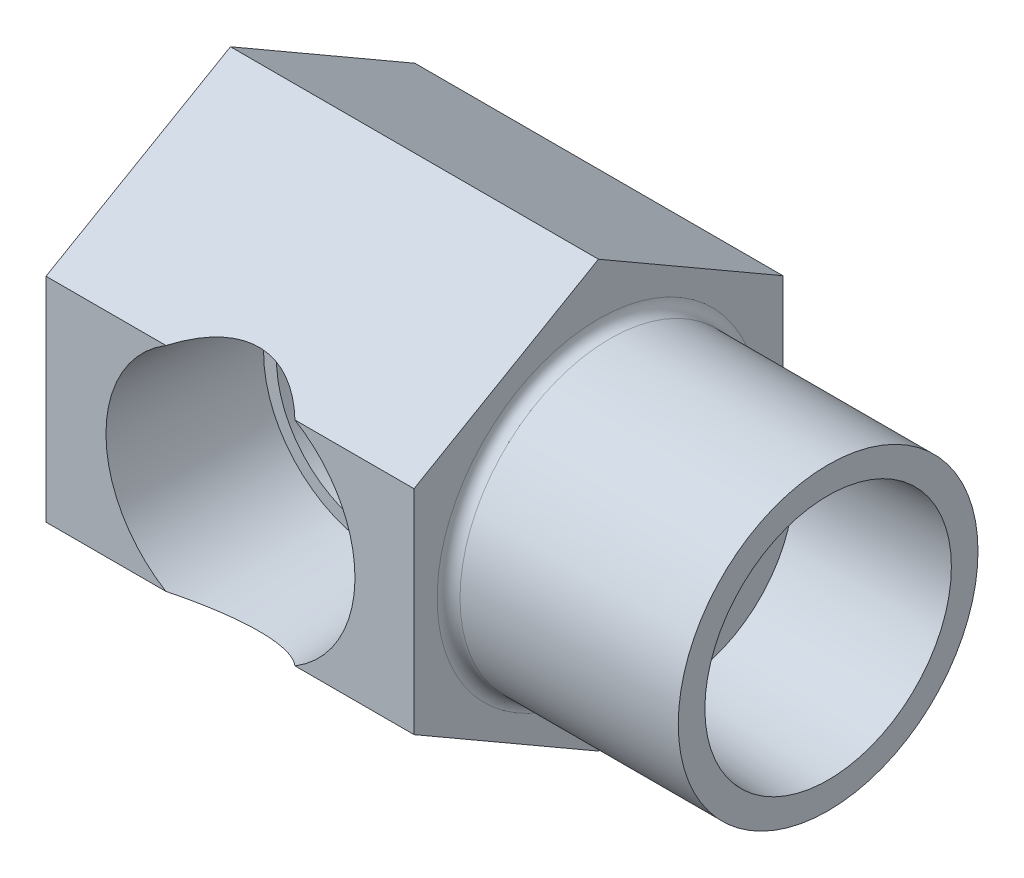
ISO-10303-21;
HEADER;
FILE_DESCRIPTION(('STEP AP214'),'2;1');
FILE_NAME('part.step','',(''),(''),'','','');
FILE_SCHEMA(('AUTOMOTIVE_DESIGN { 1 0 10303 214 1 1 1 1 }'));
ENDSEC;
DATA;
#1=APPLICATION_CONTEXT('core data for automotive mechanical design processes');
#2=APPLICATION_PROTOCOL_DEFINITION('international standard','automotive_design',2000,#1);
#3=PRODUCT_CONTEXT('',#1,'mechanical');
#4=PRODUCT('Part','Part','',(#3));
#5=PRODUCT_RELATED_PRODUCT_CATEGORY('part','',(#4));
#6=PRODUCT_DEFINITION_FORMATION('','',#4);
#7=PRODUCT_DEFINITION_CONTEXT('part definition',#1,'design');
#8=PRODUCT_DEFINITION('design','',#6,#7);
#9=PRODUCT_DEFINITION_SHAPE('','',#8);
#10=(LENGTH_UNIT() NAMED_UNIT(*) SI_UNIT(.MILLI.,.METRE.));
#11=(NAMED_UNIT(*) PLANE_ANGLE_UNIT() SI_UNIT($,.RADIAN.));
#12=(NAMED_UNIT(*) SI_UNIT($,.STERADIAN.) SOLID_ANGLE_UNIT());
#13=UNCERTAINTY_MEASURE_WITH_UNIT(LENGTH_MEASURE(1.E-05),#10,'distance_accuracy_value','');
#14=(GEOMETRIC_REPRESENTATION_CONTEXT(3) GLOBAL_UNCERTAINTY_ASSIGNED_CONTEXT((#13)) GLOBAL_UNIT_ASSIGNED_CONTEXT((#10,
#11,#12)) REPRESENTATION_CONTEXT('',''));
#15=CARTESIAN_POINT('',(0.,0.,0.));
#16=DIRECTION('',(0.,0.,1.));
#17=DIRECTION('',(1.,0.,0.));
#18=AXIS2_PLACEMENT_3D('',#15,#16,#17);
#19=CARTESIAN_POINT('',(-30.099,0.,21.5872041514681));
#20=DIRECTION('',(0.,0.,-1.));
#21=DIRECTION('',(-1.,0.,0.));
#22=AXIS2_PLACEMENT_3D('',#19,#20,#21);
#23=CYLINDRICAL_SURFACE('',#22,7.14406750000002);
#24=CARTESIAN_POINT('',(-25.1825171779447,5.18323230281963,-5.10306883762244));
#25=CARTESIAN_POINT('',(-25.2134358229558,5.2125364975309,-4.99724778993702));
#26=CARTESIAN_POINT('',(-25.2411529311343,5.23832352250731,-4.88948289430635));
#27=CARTESIAN_POINT('',(-25.2894866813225,5.28274794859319,-4.67094800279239));
#28=CARTESIAN_POINT('',(-25.3101041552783,5.30138618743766,-4.56017836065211));
#29=CARTESIAN_POINT('',(-25.3433476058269,5.33122407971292,-4.33783712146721));
#30=CARTESIAN_POINT('',(-25.3560667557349,5.34251054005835,-4.22629121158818));
#31=CARTESIAN_POINT('',(-25.3736800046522,5.35809609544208,-4.00212245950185));
#32=CARTESIAN_POINT('',(-25.3785751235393,5.36239610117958,-3.88949975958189));
#33=CARTESIAN_POINT('',(-25.3806951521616,5.36426148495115,-3.66416077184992));
#34=CARTESIAN_POINT('',(-25.3779217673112,5.36182836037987,-3.55144451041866));
#35=CARTESIAN_POINT('',(-25.3652086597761,5.35060568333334,-3.32671545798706));
#36=CARTESIAN_POINT('',(-25.3552653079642,5.341812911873,-3.2147030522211));
#37=CARTESIAN_POINT('',(-25.3156604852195,5.3064747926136,-2.88023991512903));
#38=CARTESIAN_POINT('',(-25.276225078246,5.27096911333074,-2.65981840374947));
#39=CARTESIAN_POINT('',(-25.1892935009,5.18990438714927,-2.27722295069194));
#40=CARTESIAN_POINT('',(-25.1456647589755,5.14846263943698,-2.11319388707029));
#41=CARTESIAN_POINT('',(-25.0497782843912,5.05446126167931,-1.790841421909));
#42=CARTESIAN_POINT('',(-24.9975155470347,5.001895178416,-1.63252139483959));
#43=CARTESIAN_POINT('',(-24.8866886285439,4.88630068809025,-1.32161419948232));
#44=CARTESIAN_POINT('',(-24.8281100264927,4.82324815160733,-1.1690412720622));
#45=CARTESIAN_POINT('',(-24.7067840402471,4.6872183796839,-0.870161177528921));
#46=CARTESIAN_POINT('',(-24.6440374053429,4.61424292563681,-0.723852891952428));
#47=CARTESIAN_POINT('',(-24.5125913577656,4.45432658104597,-0.429915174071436));
#48=CARTESIAN_POINT('',(-24.4437535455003,4.3668437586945,-0.28264245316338));
#49=CARTESIAN_POINT('',(-24.3050184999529,4.18102036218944,0.00439596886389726));
#50=CARTESIAN_POINT('',(-24.2351211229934,4.08267830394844,0.144160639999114));
#51=CARTESIAN_POINT('',(-24.0959483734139,3.87513309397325,0.415323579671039));
#52=CARTESIAN_POINT('',(-24.0266721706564,3.76594796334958,0.546735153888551));
#53=CARTESIAN_POINT('',(-23.8901779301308,3.53639131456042,0.800456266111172));
#54=CARTESIAN_POINT('',(-23.8229593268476,3.41602290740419,0.9227683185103));
#55=CARTESIAN_POINT('',(-23.6562040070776,3.09458840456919,1.22140921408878));
#56=CARTESIAN_POINT('',(-23.5591371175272,2.88543982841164,1.39061980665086));
#57=CARTESIAN_POINT('',(-23.3800788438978,2.4395435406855,1.69775818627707));
#58=CARTESIAN_POINT('',(-23.2980682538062,2.20283162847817,1.83572588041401));
#59=CARTESIAN_POINT('',(-23.169666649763,1.75103882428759,2.04959929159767));
#60=CARTESIAN_POINT('',(-23.1194728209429,1.54032842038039,2.13230684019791));
#61=CARTESIAN_POINT('',(-23.0580655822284,1.21458401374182,2.23300187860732));
#62=CARTESIAN_POINT('',(-23.039908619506,1.10437093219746,2.26267539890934));
#63=CARTESIAN_POINT('',(-23.0086150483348,0.881358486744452,2.31372005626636));
#64=CARTESIAN_POINT('',(-22.9954762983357,0.76856024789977,2.3350947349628));
#65=CARTESIAN_POINT('',(-22.9744822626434,0.540500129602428,2.36921140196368));
#66=CARTESIAN_POINT('',(-22.9666581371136,0.425227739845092,2.38190248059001));
#67=CARTESIAN_POINT('',(-22.9566224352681,0.193793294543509,2.39817581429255));
#68=CARTESIAN_POINT('',(-22.9544108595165,0.0776312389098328,2.40175806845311));
#69=CARTESIAN_POINT('',(-22.955661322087,-0.154575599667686,2.39973161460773));
#70=CARTESIAN_POINT('',(-22.9591231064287,-0.270620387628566,2.39412331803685));
#71=CARTESIAN_POINT('',(-22.9716252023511,-0.501604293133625,2.37384366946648));
#72=CARTESIAN_POINT('',(-22.9806653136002,-0.616543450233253,2.35917264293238));
#73=CARTESIAN_POINT('',(-23.0030876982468,-0.834690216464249,2.32270942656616));
#74=CARTESIAN_POINT('',(-23.0160344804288,-0.938063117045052,2.30163032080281));
#75=CARTESIAN_POINT('',(-23.0461272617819,-1.14253259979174,2.25251224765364));
#76=CARTESIAN_POINT('',(-23.0632745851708,-1.24362845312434,2.22447108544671));
#77=CARTESIAN_POINT('',(-23.1205336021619,-1.54266726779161,2.13054149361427));
#78=CARTESIAN_POINT('',(-23.1664750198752,-1.73647942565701,2.05482655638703));
#79=CARTESIAN_POINT('',(-23.2917093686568,-2.18452681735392,1.84642606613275));
#80=CARTESIAN_POINT('',(-23.3769973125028,-2.43206385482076,1.70306138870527));
#81=CARTESIAN_POINT('',(-23.5639813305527,-2.89730642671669,1.38229283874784));
#82=CARTESIAN_POINT('',(-23.6657145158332,-3.11494238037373,1.20481180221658));
#83=CARTESIAN_POINT('',(-23.8444772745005,-3.45587099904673,0.883882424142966));
#84=CARTESIAN_POINT('',(-23.9191235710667,-3.58721005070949,0.747463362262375));
#85=CARTESIAN_POINT('',(-24.0706021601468,-3.83632287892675,0.463752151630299));
#86=CARTESIAN_POINT('',(-24.1474353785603,-3.95409079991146,0.316455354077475));
#87=CARTESIAN_POINT('',(-24.3013098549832,-4.17645741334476,0.0119885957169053));
#88=CARTESIAN_POINT('',(-24.3783512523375,-4.28103618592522,-0.145195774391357));
#89=CARTESIAN_POINT('',(-24.530364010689,-4.47698025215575,-0.468487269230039));
#90=CARTESIAN_POINT('',(-24.6053359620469,-4.56834934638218,-0.63459180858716));
#91=CARTESIAN_POINT('',(-24.7372252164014,-4.72200481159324,-0.943602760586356));
#92=CARTESIAN_POINT('',(-24.7949050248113,-4.78653859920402,-1.08506990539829));
#93=CARTESIAN_POINT('',(-24.9057234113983,-4.9065513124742,-1.37356011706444));
#94=CARTESIAN_POINT('',(-24.9588615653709,-4.96202939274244,-1.52058370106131));
#95=CARTESIAN_POINT('',(-25.0585765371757,-5.06328662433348,-1.81962761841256));
#96=CARTESIAN_POINT('',(-25.105171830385,-5.10909327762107,-1.97163232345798));
#97=CARTESIAN_POINT('',(-25.1897450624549,-5.19040898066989,-2.28062074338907));
#98=CARTESIAN_POINT('',(-25.2277274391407,-5.2259233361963,-2.43760184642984));
#99=CARTESIAN_POINT('',(-25.3038875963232,-5.29605796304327,-2.81193496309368));
#100=CARTESIAN_POINT('',(-25.337494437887,-5.32602798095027,-3.03121193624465));
#101=CARTESIAN_POINT('',(-25.3678543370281,-5.35295298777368,-3.36310665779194));
#102=CARTESIAN_POINT('',(-25.3746346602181,-5.35892494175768,-3.474161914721));
#103=CARTESIAN_POINT('',(-25.3809554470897,-5.36449322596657,-3.69661859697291));
#104=CARTESIAN_POINT('',(-25.3804997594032,-5.36409294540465,-3.80801980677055));
#105=CARTESIAN_POINT('',(-25.3723916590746,-5.35694836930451,-4.02011673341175));
#106=CARTESIAN_POINT('',(-25.3654024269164,-5.35078866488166,-4.12085817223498));
#107=CARTESIAN_POINT('',(-25.3451606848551,-5.33281293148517,-4.32121383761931));
#108=CARTESIAN_POINT('',(-25.3319077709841,-5.32099653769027,-4.4208279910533));
#109=CARTESIAN_POINT('',(-25.2992340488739,-5.29154446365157,-4.61905715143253));
#110=CARTESIAN_POINT('',(-25.2797612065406,-5.27385963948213,-4.71765621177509));
#111=CARTESIAN_POINT('',(-25.2352108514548,-5.23279404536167,-4.91237330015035));
#112=CARTESIAN_POINT('',(-25.2101333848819,-5.20941332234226,-5.00849134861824));
#113=CARTESIAN_POINT('',(-25.1825171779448,-5.18323230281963,-5.10306883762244));
#114=B_SPLINE_CURVE_WITH_KNOTS('',3,(#24,#25,#26,#27,#28,#29,#30,#31,#32,#33,#34,#35,#36,#37,
#38,#39,#40,#41,#42,#43,#44,#45,#46,#47,#48,#49,#50,#51,#52,#53,#54,#55,#56,#57,#58,#59,#60,#61,
#62,#63,#64,#65,#66,#67,#68,#69,#70,#71,#72,#73,#74,#75,#76,#77,#78,#79,#80,#81,#82,#83,#84,#85,
#86,#87,#88,#89,#90,#91,#92,#93,#94,#95,#96,#97,#98,#99,#100,#101,#102,#103,#104,#105,#106,#107,
#108,#109,#110,#111,#112,#113),.UNSPECIFIED.,.F.,.F.,(4,2,2,2,2,2,2,2,2,2,2,2,2,2,2,2,2,2,2,2,2,
2,2,2,2,2,2,2,2,2,2,2,2,2,2,2,2,2,2,2,2,2,2,2,4),(0.,0.342156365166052,0.684272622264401,
1.02227233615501,1.36022798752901,1.69810848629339,2.03616012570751,2.71361266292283,
3.23713824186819,3.76096835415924,4.28602091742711,4.81097934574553,5.36433689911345,
5.91777017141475,6.47029856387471,7.02267370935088,7.87767210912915,8.73157216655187,
9.42404528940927,9.77039312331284,10.1165929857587,10.4648055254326,10.8130181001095,
11.1612150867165,11.5093995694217,11.8279236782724,12.1465483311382,12.7834405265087,
13.6741273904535,14.5668530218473,15.1767808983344,15.7869709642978,16.3980718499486,
17.008996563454,17.5061695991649,18.0033890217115,18.4991749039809,18.9947047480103,
19.6634161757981,19.9973397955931,20.3310858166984,20.6342544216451,20.9374425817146,
21.2432366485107,21.5490281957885),.UNSPECIFIED.);
#115=CARTESIAN_POINT('',(-25.1825171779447,5.18323230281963,-5.10306883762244));
#116=VERTEX_POINT('',#115);
#117=CARTESIAN_POINT('',(-22.9631444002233,0.342440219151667,2.3876));
#118=VERTEX_POINT('',#117);
#119=EDGE_CURVE('E237',#116,#118,#114,.T.);
#120=ORIENTED_EDGE('',*,*,#119,.T.);
#121=CARTESIAN_POINT('',(-30.099,0.,2.3876));
#122=DIRECTION('',(0.,0.,-1.));
#123=DIRECTION('',(-1.,0.,0.));
#124=AXIS2_PLACEMENT_3D('',#121,#122,#123);
#125=CIRCLE('',#124,7.14406750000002);
#126=CARTESIAN_POINT('',(-22.9631444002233,-0.34244021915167,2.3876));
#127=VERTEX_POINT('',#126);
#128=EDGE_CURVE('E253',#127,#118,#125,.T.);
#129=ORIENTED_EDGE('',*,*,#128,.F.);
#130=CARTESIAN_POINT('',(-25.1825171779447,-5.18323230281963,-5.10306883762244));
#131=VERTEX_POINT('',#130);
#132=EDGE_CURVE('E242',#127,#131,#114,.T.);
#133=ORIENTED_EDGE('',*,*,#132,.T.);
#134=CARTESIAN_POINT('',(-30.099,0.,-5.10306883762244));
#135=DIRECTION('',(0.,0.,-1.));
#136=DIRECTION('',(-1.,0.,0.));
#137=AXIS2_PLACEMENT_3D('',#134,#135,#136);
#138=CIRCLE('',#137,7.14406750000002);
#139=EDGE_CURVE('E156',#131,#116,#138,.T.);
#140=ORIENTED_EDGE('',*,*,#139,.T.);
#141=EDGE_LOOP('',(#120,#129,#133,#140));
#142=FACE_BOUND('',#141,.T.);
#143=ADVANCED_FACE('F16',(#142),#23,.F.);
#144=CARTESIAN_POINT('',(-30.099,0.,-5.10306883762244));
#145=DIRECTION('',(0.,0.,1.));
#146=DIRECTION('',(1.,0.,0.));
#147=AXIS2_PLACEMENT_3D('',#144,#145,#146);
#148=CONICAL_SURFACE('',#147,7.14406750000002,1.04719755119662);
#149=CARTESIAN_POINT('',(-25.1825171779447,-5.18323230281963,-5.10306883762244));
#150=CARTESIAN_POINT('',(-25.3469842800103,-5.17572120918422,-5.1715318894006));
#151=CARTESIAN_POINT('',(-25.5120421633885,-5.16835793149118,-5.23864719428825));
#152=CARTESIAN_POINT('',(-25.8436489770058,-5.15434361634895,-5.36935899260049));
#153=CARTESIAN_POINT('',(-26.0101984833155,-5.14769286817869,-5.43295405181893));
#154=CARTESIAN_POINT('',(-26.343700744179,-5.13557293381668,-5.55528142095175));
#155=CARTESIAN_POINT('',(-26.5106409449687,-5.13009520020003,-5.61404684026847));
#156=CARTESIAN_POINT('',(-26.846397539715,-5.12076773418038,-5.72613227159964));
#157=CARTESIAN_POINT('',(-27.0152139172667,-5.11691798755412,-5.77945233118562));
#158=CARTESIAN_POINT('',(-27.355598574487,-5.11139042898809,-5.87951332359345));
#159=CARTESIAN_POINT('',(-27.5271753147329,-5.10972161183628,-5.92622630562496));
#160=CARTESIAN_POINT('',(-27.8723671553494,-5.109127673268,-6.0112440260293));
#161=CARTESIAN_POINT('',(-28.0459815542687,-5.11020163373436,-6.04955157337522));
#162=CARTESIAN_POINT('',(-28.3963708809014,-5.11550120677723,-6.11643861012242));
#163=CARTESIAN_POINT('',(-28.5731595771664,-5.11974951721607,-6.14494586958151));
#164=CARTESIAN_POINT('',(-28.8394629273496,-5.12853623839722,-6.17915788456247));
#165=CARTESIAN_POINT('',(-28.9284819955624,-5.1318707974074,-6.18914118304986));
#166=CARTESIAN_POINT('',(-29.1067808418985,-5.13929518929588,-6.20615929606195));
#167=CARTESIAN_POINT('',(-29.1960606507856,-5.143385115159,-6.21319374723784));
#168=CARTESIAN_POINT('',(-29.2854243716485,-5.14782710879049,-6.21870997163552));
#169=B_SPLINE_CURVE_WITH_KNOTS('',3,(#149,#150,#151,#152,#153,#154,#155,#156,#157,#158,#159,
#160,#161,#162,#163,#164,#165,#166,#167,#168),.UNSPECIFIED.,.F.,.F.,(4,2,2,2,2,2,2,2,2,4),(0.,
0.534943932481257,1.07010422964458,1.60122122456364,2.13233357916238,2.66562955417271,
3.19874703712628,3.73571344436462,4.00458451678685,4.27348870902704),.UNSPECIFIED.);
#170=CARTESIAN_POINT('',(-29.2854243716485,-5.1478271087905,-6.21870997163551));
#171=VERTEX_POINT('',#170);
#172=EDGE_CURVE('E178',#131,#171,#169,.T.);
#173=ORIENTED_EDGE('',*,*,#172,.T.);
#174=CARTESIAN_POINT('',(-31.7957247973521,0.,-8.24809361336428));
#175=CARTESIAN_POINT('',(-31.7957251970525,-0.0274640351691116,-8.24809393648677));
#176=CARTESIAN_POINT('',(-31.7954470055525,-0.0549279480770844,-8.24786904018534));
#177=CARTESIAN_POINT('',(-31.7943040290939,-0.111429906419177,-8.24694503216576));
#178=CARTESIAN_POINT('',(-31.7934061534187,-0.140466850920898,-8.24621916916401));
#179=CARTESIAN_POINT('',(-31.7910605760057,-0.196877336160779,-8.24432295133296));
#180=CARTESIAN_POINT('',(-31.7896463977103,-0.224253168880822,-8.24317969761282));
#181=CARTESIAN_POINT('',(-31.7873871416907,-0.260889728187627,-8.24135326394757));
#182=CARTESIAN_POINT('',(-31.7867828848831,-0.270175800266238,-8.24086476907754));
#183=CARTESIAN_POINT('',(-31.7836048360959,-0.316593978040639,-8.23829556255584));
#184=CARTESIAN_POINT('',(-31.7805616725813,-0.353674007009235,-8.23583540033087));
#185=CARTESIAN_POINT('',(-31.7699385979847,-0.464889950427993,-8.22724746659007));
#186=CARTESIAN_POINT('',(-31.7608736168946,-0.538798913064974,-8.21991913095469));
#187=CARTESIAN_POINT('',(-31.7390322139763,-0.685663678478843,-8.20226204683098));
#188=CARTESIAN_POINT('',(-31.7262569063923,-0.758619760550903,-8.19193419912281));
#189=CARTESIAN_POINT('',(-31.6878693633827,-0.950455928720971,-8.1609008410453));
#190=CARTESIAN_POINT('',(-31.6593100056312,-1.0683715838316,-8.13781281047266));
#191=CARTESIAN_POINT('',(-31.594363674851,-1.30059649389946,-8.08530872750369));
#192=CARTESIAN_POINT('',(-31.5579712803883,-1.4149031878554,-8.05588829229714));
#193=CARTESIAN_POINT('',(-31.4783864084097,-1.64099448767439,-7.99155008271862));
#194=CARTESIAN_POINT('',(-31.4351243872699,-1.7527382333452,-7.95657608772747));
#195=CARTESIAN_POINT('',(-31.3433919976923,-1.97252998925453,-7.88241754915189));
#196=CARTESIAN_POINT('',(-31.2949239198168,-2.08057959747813,-7.84323485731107));
#197=CARTESIAN_POINT('',(-31.1647787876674,-2.35447242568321,-7.73802258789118));
#198=CARTESIAN_POINT('',(-31.0800118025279,-2.51788070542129,-7.66949504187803));
#199=CARTESIAN_POINT('',(-30.9030855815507,-2.83797801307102,-7.52646388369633));
#200=CARTESIAN_POINT('',(-30.810921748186,-2.99466276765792,-7.45195655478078));
#201=CARTESIAN_POINT('',(-30.6208713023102,-3.30308219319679,-7.29831547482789));
#202=CARTESIAN_POINT('',(-30.5229649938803,-3.45479666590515,-7.21916580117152));
#203=CARTESIAN_POINT('',(-30.3231361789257,-3.75369342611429,-7.05761966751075));
#204=CARTESIAN_POINT('',(-30.2212146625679,-3.90087681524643,-6.97522400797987));
#205=CARTESIAN_POINT('',(-30.0208420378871,-4.18237274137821,-6.81323824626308));
#206=CARTESIAN_POINT('',(-29.9225806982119,-4.31690960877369,-6.73380155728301));
#207=CARTESIAN_POINT('',(-29.7238967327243,-4.58333283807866,-6.57318094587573));
#208=CARTESIAN_POINT('',(-29.6234739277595,-4.71521897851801,-6.49199687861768));
#209=CARTESIAN_POINT('',(-29.421753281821,-4.97566041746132,-6.32892134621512));
#210=CARTESIAN_POINT('',(-29.3204700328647,-5.10423445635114,-6.24704167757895));
#211=CARTESIAN_POINT('',(-29.1165153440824,-5.35949358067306,-6.08216009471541));
#212=CARTESIAN_POINT('',(-29.0138442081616,-5.48617906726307,-5.99915842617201));
#213=CARTESIAN_POINT('',(-28.910614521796,-5.61209686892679,-5.9157052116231));
#214=B_SPLINE_CURVE_WITH_KNOTS('',3,(#174,#175,#176,#177,#178,#179,#180,#181,#182,#183,#184,
#185,#186,#187,#188,#189,#190,#191,#192,#193,#194,#195,#196,#197,#198,#199,#200,#201,#202,#203,
#204,#205,#206,#207,#208,#209,#210,#211,#212,#213),.UNSPECIFIED.,.F.,.F.,(4,2,2,2,2,2,2,2,2,2,2,
2,2,2,2,2,2,2,2,4),(0.,0.0823896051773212,0.169558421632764,0.25185685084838,0.279812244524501,
0.391649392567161,0.615931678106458,0.840146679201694,1.21006057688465,1.58023132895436,
1.95442132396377,2.32844735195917,2.91721354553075,3.50634856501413,4.09763808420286,
4.68878269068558,5.24244167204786,5.79614672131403,6.34516704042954,6.89406902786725),.UNSPECIFIED.);
#215=CARTESIAN_POINT('',(-31.7957247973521,0.,-8.24809361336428));
#216=VERTEX_POINT('',#215);
#217=EDGE_CURVE('E190',#171,#216,#214,.F.);
#218=ORIENTED_EDGE('',*,*,#217,.T.);
#219=CARTESIAN_POINT('',(-31.7957247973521,0.,-8.24809361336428));
#220=CARTESIAN_POINT('',(-31.7957251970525,0.0274640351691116,-8.24809393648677));
#221=CARTESIAN_POINT('',(-31.7954470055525,0.0549279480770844,-8.24786904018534));
#222=CARTESIAN_POINT('',(-31.7943040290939,0.111429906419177,-8.24694503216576));
#223=CARTESIAN_POINT('',(-31.7934061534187,0.140466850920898,-8.24621916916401));
#224=CARTESIAN_POINT('',(-31.7910605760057,0.196877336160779,-8.24432295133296));
#225=CARTESIAN_POINT('',(-31.7896463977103,0.224253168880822,-8.24317969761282));
#226=CARTESIAN_POINT('',(-31.7873871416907,0.260889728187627,-8.24135326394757));
#227=CARTESIAN_POINT('',(-31.7867828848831,0.270175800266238,-8.24086476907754));
#228=CARTESIAN_POINT('',(-31.7836048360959,0.316593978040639,-8.23829556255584));
#229=CARTESIAN_POINT('',(-31.7805616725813,0.353674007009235,-8.23583540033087));
#230=CARTESIAN_POINT('',(-31.7699385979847,0.464889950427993,-8.22724746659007));
#231=CARTESIAN_POINT('',(-31.7608736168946,0.538798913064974,-8.21991913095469));
#232=CARTESIAN_POINT('',(-31.7390322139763,0.685663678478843,-8.20226204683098));
#233=CARTESIAN_POINT('',(-31.7262569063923,0.758619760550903,-8.19193419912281));
#234=CARTESIAN_POINT('',(-31.6878693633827,0.950455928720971,-8.1609008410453));
#235=CARTESIAN_POINT('',(-31.6593100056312,1.0683715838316,-8.13781281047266));
#236=CARTESIAN_POINT('',(-31.594363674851,1.30059649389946,-8.08530872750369));
#237=CARTESIAN_POINT('',(-31.5579712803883,1.4149031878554,-8.05588829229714));
#238=CARTESIAN_POINT('',(-31.4783864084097,1.64099448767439,-7.99155008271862));
#239=CARTESIAN_POINT('',(-31.4351243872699,1.7527382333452,-7.95657608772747));
#240=CARTESIAN_POINT('',(-31.3433919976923,1.97252998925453,-7.88241754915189));
#241=CARTESIAN_POINT('',(-31.2949239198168,2.08057959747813,-7.84323485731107));
#242=CARTESIAN_POINT('',(-31.1647787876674,2.35447242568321,-7.73802258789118));
#243=CARTESIAN_POINT('',(-31.0800118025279,2.51788070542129,-7.66949504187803));
#244=CARTESIAN_POINT('',(-30.9030855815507,2.83797801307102,-7.52646388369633));
#245=CARTESIAN_POINT('',(-30.810921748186,2.99466276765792,-7.45195655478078));
#246=CARTESIAN_POINT('',(-30.6208713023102,3.30308219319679,-7.29831547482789));
#247=CARTESIAN_POINT('',(-30.5229649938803,3.45479666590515,-7.21916580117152));
#248=CARTESIAN_POINT('',(-30.3231361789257,3.75369342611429,-7.05761966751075));
#249=CARTESIAN_POINT('',(-30.2212146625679,3.90087681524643,-6.97522400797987));
#250=CARTESIAN_POINT('',(-30.0208420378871,4.18237274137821,-6.81323824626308));
#251=CARTESIAN_POINT('',(-29.9225806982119,4.31690960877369,-6.73380155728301));
#252=CARTESIAN_POINT('',(-29.7238967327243,4.58333283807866,-6.57318094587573));
#253=CARTESIAN_POINT('',(-29.6234739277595,4.71521897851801,-6.49199687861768));
#254=CARTESIAN_POINT('',(-29.421753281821,4.97566041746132,-6.32892134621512));
#255=CARTESIAN_POINT('',(-29.3204700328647,5.10423445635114,-6.24704167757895));
#256=CARTESIAN_POINT('',(-29.1165153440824,5.35949358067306,-6.08216009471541));
#257=CARTESIAN_POINT('',(-29.0138442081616,5.48617906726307,-5.99915842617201));
#258=CARTESIAN_POINT('',(-28.910614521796,5.61209686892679,-5.9157052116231));
#259=B_SPLINE_CURVE_WITH_KNOTS('',3,(#219,#220,#221,#222,#223,#224,#225,#226,#227,#228,#229,
#230,#231,#232,#233,#234,#235,#236,#237,#238,#239,#240,#241,#242,#243,#244,#245,#246,#247,#248,
#249,#250,#251,#252,#253,#254,#255,#256,#257,#258),.UNSPECIFIED.,.F.,.F.,(4,2,2,2,2,2,2,2,2,2,2,
2,2,2,2,2,2,2,2,4),(0.,0.0823896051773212,0.169558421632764,0.25185685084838,0.279812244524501,
0.391649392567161,0.615931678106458,0.840146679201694,1.21006057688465,1.58023132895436,
1.95442132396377,2.32844735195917,2.91721354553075,3.50634856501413,4.09763808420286,
4.68878269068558,5.24244167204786,5.79614672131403,6.34516704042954,6.89406902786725),.UNSPECIFIED.);
#260=CARTESIAN_POINT('',(-29.2854243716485,5.1478271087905,-6.21870997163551));
#261=VERTEX_POINT('',#260);
#262=EDGE_CURVE('E182',#216,#261,#259,.T.);
#263=ORIENTED_EDGE('',*,*,#262,.T.);
#264=CARTESIAN_POINT('',(-29.2854243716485,5.1478271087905,-6.21870997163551));
#265=CARTESIAN_POINT('',(-29.1670562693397,5.14193157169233,-6.21142130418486));
#266=CARTESIAN_POINT('',(-29.0488327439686,5.13667210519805,-6.20144083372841));
#267=CARTESIAN_POINT('',(-28.812916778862,5.12750491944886,-6.17636280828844));
#268=CARTESIAN_POINT('',(-28.6952241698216,5.12359673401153,-6.16126702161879));
#269=CARTESIAN_POINT('',(-28.4608472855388,5.11721617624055,-6.12626687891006));
#270=CARTESIAN_POINT('',(-28.3441611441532,5.1147399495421,-6.10637563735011));
#271=CARTESIAN_POINT('',(-28.1116071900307,5.11116745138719,-6.06216979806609));
#272=CARTESIAN_POINT('',(-27.9957394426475,5.11007128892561,-6.03785485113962));
#273=CARTESIAN_POINT('',(-27.6513748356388,5.10872325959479,-5.9593833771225));
#274=CARTESIAN_POINT('',(-27.4241914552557,5.11036226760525,-5.89939816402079));
#275=CARTESIAN_POINT('',(-26.9733385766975,5.1175169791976,-5.76740557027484));
#276=CARTESIAN_POINT('',(-26.7496714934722,5.12303523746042,-5.69539029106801));
#277=CARTESIAN_POINT('',(-26.4142728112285,5.13331905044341,-5.57987058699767));
#278=CARTESIAN_POINT('',(-26.3013534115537,5.13713031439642,-5.53967028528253));
#279=CARTESIAN_POINT('',(-26.0763038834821,5.14527375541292,-5.45727230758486));
#280=CARTESIAN_POINT('',(-25.9641735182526,5.14960576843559,-5.41507526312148));
#281=CARTESIAN_POINT('',(-25.7401138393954,5.15867196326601,-5.32877675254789));
#282=CARTESIAN_POINT('',(-25.6281874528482,5.16340779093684,-5.28466789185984));
#283=CARTESIAN_POINT('',(-25.4049228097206,5.17314824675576,-5.19494012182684));
#284=CARTESIAN_POINT('',(-25.2935846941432,5.17815293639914,-5.14932086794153));
#285=CARTESIAN_POINT('',(-25.1825171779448,5.18323230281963,-5.10306883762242));
#286=B_SPLINE_CURVE_WITH_KNOTS('',3,(#264,#265,#266,#267,#268,#269,#270,#271,#272,#273,#274,
#275,#276,#277,#278,#279,#280,#281,#282,#283,#284,#285),.UNSPECIFIED.,.F.,.F.,(4,2,2,2,2,2,2,2,
2,2,4),(0.,0.3561688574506,0.712214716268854,1.06729770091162,1.42240872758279,2.12679779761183,
2.83165117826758,3.19140184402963,3.55103948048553,3.91222024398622,4.27348397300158),.UNSPECIFIED.);
#287=EDGE_CURVE('E216',#261,#116,#286,.T.);
#288=ORIENTED_EDGE('',*,*,#287,.T.);
#289=ORIENTED_EDGE('',*,*,#139,.F.);
#290=EDGE_LOOP('',(#173,#218,#263,#288,#289));
#291=FACE_BOUND('',#290,.T.);
#292=ADVANCED_FACE('F195',(#291),#148,.F.);
#293=CARTESIAN_POINT('',(-11.9634,0.,0.));
#294=DIRECTION('',(1.,0.,0.));
#295=DIRECTION('',(0.,0.,-1.));
#296=AXIS2_PLACEMENT_3D('',#293,#294,#295);
#297=PLANE('',#296);
#298=CARTESIAN_POINT('',(-11.9634,0.,0.));
#299=DIRECTION('',(1.,0.,0.));
#300=DIRECTION('',(0.,0.,-1.));
#301=AXIS2_PLACEMENT_3D('',#298,#299,#300);
#302=CIRCLE('',#301,7.94552477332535);
#303=CARTESIAN_POINT('',(-11.9634,0.,-7.94552477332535));
#304=VERTEX_POINT('',#303);
#305=EDGE_CURVE('E157',#304,#304,#302,.F.);
#306=ORIENTED_EDGE('',*,*,#305,.F.);
#307=EDGE_LOOP('',(#306));
#308=FACE_BOUND('',#307,.T.);
#309=CARTESIAN_POINT('',(-11.9634,0.,-0.408685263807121));
#310=DIRECTION('',(1.,0.,0.));
#311=DIRECTION('',(0.,0.,1.));
#312=AXIS2_PLACEMENT_3D('',#309,#310,#311);
#313=ELLIPSE('',#312,5.55315288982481,5.39045841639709);
#314=CARTESIAN_POINT('',(-11.9634,0.,5.14446762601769));
#315=VERTEX_POINT('',#314);
#316=EDGE_CURVE('E179',#315,#315,#313,.F.);
#317=ORIENTED_EDGE('',*,*,#316,.T.);
#318=EDGE_LOOP('',(#317));
#319=FACE_BOUND('',#318,.T.);
#320=ADVANCED_FACE('F281',(#308,#319),#297,.T.);
#321=CARTESIAN_POINT('',(-1.651,0.,0.));
#322=DIRECTION('',(-1.,0.,0.));
#323=DIRECTION('',(0.,0.,1.));
#324=AXIS2_PLACEMENT_3D('',#321,#322,#323);
#325=PLANE('',#324);
#326=CARTESIAN_POINT('',(-1.651,0.,0.));
#327=DIRECTION('',(-1.,0.,0.));
#328=DIRECTION('',(0.,0.,1.));
#329=AXIS2_PLACEMENT_3D('',#326,#327,#328);
#330=CIRCLE('',#329,10.31875);
#331=CARTESIAN_POINT('',(-1.651,0.,10.31875));
#332=VERTEX_POINT('',#331);
#333=EDGE_CURVE('E149',#332,#332,#330,.T.);
#334=ORIENTED_EDGE('',*,*,#333,.F.);
#335=EDGE_LOOP('',(#334));
#336=FACE_BOUND('',#335,.T.);
#337=CARTESIAN_POINT('',(-1.651,0.,0.));
#338=DIRECTION('',(-1.,0.,0.));
#339=DIRECTION('',(0.,0.,1.));
#340=AXIS2_PLACEMENT_3D('',#337,#338,#339);
#341=CIRCLE('',#340,8.48597475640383);
#342=CARTESIAN_POINT('',(-1.651,0.,8.48597475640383));
#343=VERTEX_POINT('',#342);
#344=EDGE_CURVE('E153',#343,#343,#341,.T.);
#345=ORIENTED_EDGE('',*,*,#344,.T.);
#346=EDGE_LOOP('',(#345));
#347=FACE_BOUND('',#346,.T.);
#348=ADVANCED_FACE('F286',(#336,#347),#325,.F.);
#349=CARTESIAN_POINT('',(-17.4625,14.6646968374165,0.));
#350=DIRECTION('',(0.,-0.866025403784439,-0.5));
#351=DIRECTION('',(0.,0.5,-0.866025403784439));
#352=AXIS2_PLACEMENT_3D('',#349,#350,#351);
#353=PLANE('',#352);
#354=CARTESIAN_POINT('',(-30.099,-0.845534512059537,26.8645087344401));
#355=DIRECTION('',(0.,-0.866025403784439,-0.5));
#356=DIRECTION('',(0.,-0.5,0.866025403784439));
#357=AXIS2_PLACEMENT_3D('',#354,#355,#356);
#358=ELLIPSE('',#357,18.6296608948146,9.27637524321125);
#359=CARTESIAN_POINT('',(-25.6577813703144,7.33234841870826,12.7));
#360=VERTEX_POINT('',#359);
#361=CARTESIAN_POINT('',(-34.5402186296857,7.33234841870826,12.7));
#362=VERTEX_POINT('',#361);
#363=EDGE_CURVE('E152',#360,#362,#358,.F.);
#364=ORIENTED_EDGE('',*,*,#363,.F.);
#365=DIRECTION('',(-1.,0.,0.));
#366=VECTOR('',#365,1.);
#367=CARTESIAN_POINT('',(-17.4625,7.33234841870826,12.7));
#368=LINE('',#367,#366);
#369=CARTESIAN_POINT('',(-17.4625,7.33234841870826,12.7));
#370=VERTEX_POINT('',#369);
#371=EDGE_CURVE('E573',#370,#360,#368,.T.);
#372=ORIENTED_EDGE('',*,*,#371,.F.);
#373=DIRECTION('',(0.,-0.5,0.866025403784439));
#374=VECTOR('',#373,1.);
#375=CARTESIAN_POINT('',(-17.4625,14.6646968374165,0.));
#376=LINE('',#375,#374);
#377=CARTESIAN_POINT('',(-17.4625,14.6646968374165,0.));
#378=VERTEX_POINT('',#377);
#379=EDGE_CURVE('E580',#378,#370,#376,.T.);
#380=ORIENTED_EDGE('',*,*,#379,.F.);
#381=DIRECTION('',(-1.,0.,0.));
#382=VECTOR('',#381,1.);
#383=CARTESIAN_POINT('',(-17.4625,14.6646968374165,0.));
#384=LINE('',#383,#382);
#385=CARTESIAN_POINT('',(-42.799,14.6646968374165,0.));
#386=VERTEX_POINT('',#385);
#387=EDGE_CURVE('E142',#378,#386,#384,.T.);
#388=ORIENTED_EDGE('',*,*,#387,.T.);
#389=DIRECTION('',(0.,-0.5,0.866025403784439));
#390=VECTOR('',#389,1.);
#391=CARTESIAN_POINT('',(-42.799,14.6646968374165,0.));
#392=LINE('',#391,#390);
#393=CARTESIAN_POINT('',(-42.799,7.33234841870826,12.7));
#394=VERTEX_POINT('',#393);
#395=EDGE_CURVE('E166',#386,#394,#392,.T.);
#396=ORIENTED_EDGE('',*,*,#395,.T.);
#397=EDGE_CURVE('E570',#362,#394,#368,.T.);
#398=ORIENTED_EDGE('',*,*,#397,.F.);
#399=EDGE_LOOP('',(#364,#372,#380,#388,#396,#398));
#400=FACE_BOUND('',#399,.T.);
#401=ADVANCED_FACE('F292',(#400),#353,.F.);
#402=CARTESIAN_POINT('',(-17.4625,7.33234841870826,12.7));
#403=DIRECTION('',(0.,0.,-1.));
#404=DIRECTION('',(0.,1.,0.));
#405=AXIS2_PLACEMENT_3D('',#402,#403,#404);
#406=PLANE('',#405);
#407=CARTESIAN_POINT('',(-30.099,0.,12.7));
#408=DIRECTION('',(0.,0.,-1.));
#409=DIRECTION('',(-1.,0.,0.));
#410=AXIS2_PLACEMENT_3D('',#407,#408,#409);
#411=CIRCLE('',#410,8.5725);
#412=CARTESIAN_POINT('',(-34.5402186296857,-7.33234841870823,12.7));
#413=VERTEX_POINT('',#412);
#414=EDGE_CURVE('E257',#413,#362,#411,.T.);
#415=ORIENTED_EDGE('',*,*,#414,.T.);
#416=ORIENTED_EDGE('',*,*,#397,.T.);
#417=DIRECTION('',(0.,-1.,0.));
#418=VECTOR('',#417,1.);
#419=CARTESIAN_POINT('',(-42.799,7.33234841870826,12.7));
#420=LINE('',#419,#418);
#421=CARTESIAN_POINT('',(-42.799,-7.33234841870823,12.7));
#422=VERTEX_POINT('',#421);
#423=EDGE_CURVE('E170',#394,#422,#420,.T.);
#424=ORIENTED_EDGE('',*,*,#423,.T.);
#425=DIRECTION('',(-1.,0.,0.));
#426=VECTOR('',#425,1.);
#427=CARTESIAN_POINT('',(-17.4625,-7.33234841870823,12.7));
#428=LINE('',#427,#426);
#429=EDGE_CURVE('E562',#413,#422,#428,.T.);
#430=ORIENTED_EDGE('',*,*,#429,.F.);
#431=EDGE_LOOP('',(#415,#416,#424,#430));
#432=FACE_BOUND('',#431,.T.);
#433=ADVANCED_FACE('F314',(#432),#406,.F.);
#434=CARTESIAN_POINT('',(-30.099,0.,12.7));
#435=DIRECTION('',(0.,0.,-1.));
#436=DIRECTION('',(-1.,0.,0.));
#437=AXIS2_PLACEMENT_3D('',#434,#435,#436);
#438=CIRCLE('',#437,8.5725);
#439=CARTESIAN_POINT('',(-25.6577813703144,-7.33234841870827,12.7));
#440=VERTEX_POINT('',#439);
#441=EDGE_CURVE('E255',#360,#440,#438,.T.);
#442=ORIENTED_EDGE('',*,*,#441,.T.);
#443=CARTESIAN_POINT('',(-17.4625,-7.33234841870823,12.7));
#444=VERTEX_POINT('',#443);
#445=EDGE_CURVE('E563',#444,#440,#428,.T.);
#446=ORIENTED_EDGE('',*,*,#445,.F.);
#447=DIRECTION('',(0.,-1.,0.));
#448=VECTOR('',#447,1.);
#449=CARTESIAN_POINT('',(-17.4625,7.33234841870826,12.7));
#450=LINE('',#449,#448);
#451=EDGE_CURVE('E582',#370,#444,#450,.T.);
#452=ORIENTED_EDGE('',*,*,#451,.F.);
#453=ORIENTED_EDGE('',*,*,#371,.T.);
#454=EDGE_LOOP('',(#442,#446,#452,#453));
#455=FACE_BOUND('',#454,.T.);
#456=ADVANCED_FACE('F318',(#455),#406,.F.);
#457=CARTESIAN_POINT('',(-17.4625,-7.33234841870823,12.7));
#458=DIRECTION('',(0.,0.866025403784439,-0.5));
#459=DIRECTION('',(0.,0.5,0.866025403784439));
#460=AXIS2_PLACEMENT_3D('',#457,#458,#459);
#461=PLANE('',#460);
#462=CARTESIAN_POINT('',(-30.099,0.845534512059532,26.8645087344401));
#463=DIRECTION('',(0.,0.866025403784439,-0.5));
#464=DIRECTION('',(0.,0.5,0.866025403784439));
#465=AXIS2_PLACEMENT_3D('',#462,#463,#464);
#466=ELLIPSE('',#465,18.6296608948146,9.27637524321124);
#467=EDGE_CURVE('E148',#413,#440,#466,.F.);
#468=ORIENTED_EDGE('',*,*,#467,.F.);
#469=ORIENTED_EDGE('',*,*,#429,.T.);
#470=DIRECTION('',(0.,-0.5,-0.866025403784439));
#471=VECTOR('',#470,1.);
#472=CARTESIAN_POINT('',(-42.799,-7.33234841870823,12.7));
#473=LINE('',#472,#471);
#474=CARTESIAN_POINT('',(-42.799,-14.6646968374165,0.));
#475=VERTEX_POINT('',#474);
#476=EDGE_CURVE('E132',#422,#475,#473,.T.);
#477=ORIENTED_EDGE('',*,*,#476,.T.);
#478=DIRECTION('',(-1.,0.,0.));
#479=VECTOR('',#478,1.);
#480=CARTESIAN_POINT('',(-17.4625,-14.6646968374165,0.));
#481=LINE('',#480,#479);
#482=CARTESIAN_POINT('',(-17.4625,-14.6646968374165,0.));
#483=VERTEX_POINT('',#482);
#484=EDGE_CURVE('E568',#483,#475,#481,.T.);
#485=ORIENTED_EDGE('',*,*,#484,.F.);
#486=DIRECTION('',(0.,-0.5,-0.866025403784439));
#487=VECTOR('',#486,1.);
#488=CARTESIAN_POINT('',(-17.4625,-7.33234841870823,12.7));
#489=LINE('',#488,#487);
#490=EDGE_CURVE('E128',#444,#483,#489,.T.);
#491=ORIENTED_EDGE('',*,*,#490,.F.);
#492=ORIENTED_EDGE('',*,*,#445,.T.);
#493=EDGE_LOOP('',(#468,#469,#477,#485,#491,#492));
#494=FACE_BOUND('',#493,.T.);
#495=ADVANCED_FACE('F305',(#494),#461,.F.);
#496=CARTESIAN_POINT('',(-17.4625,-14.6646968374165,0.));
#497=DIRECTION('',(0.,0.866025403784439,0.5));
#498=DIRECTION('',(0.,-0.5,0.866025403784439));
#499=AXIS2_PLACEMENT_3D('',#496,#497,#498);
#500=PLANE('',#499);
#501=DIRECTION('',(0.,0.5,-0.866025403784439));
#502=VECTOR('',#501,1.);
#503=CARTESIAN_POINT('',(-42.799,-14.6646968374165,0.));
#504=LINE('',#503,#502);
#505=CARTESIAN_POINT('',(-42.799,-7.33234841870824,-12.7));
#506=VERTEX_POINT('',#505);
#507=EDGE_CURVE('E136',#475,#506,#504,.T.);
#508=ORIENTED_EDGE('',*,*,#507,.T.);
#509=DIRECTION('',(-1.,0.,0.));
#510=VECTOR('',#509,1.);
#511=CARTESIAN_POINT('',(-17.4625,-7.33234841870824,-12.7));
#512=LINE('',#511,#510);
#513=CARTESIAN_POINT('',(-17.4625,-7.33234841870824,-12.7));
#514=VERTEX_POINT('',#513);
#515=EDGE_CURVE('E116',#514,#506,#512,.T.);
#516=ORIENTED_EDGE('',*,*,#515,.F.);
#517=DIRECTION('',(0.,0.5,-0.866025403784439));
#518=VECTOR('',#517,1.);
#519=CARTESIAN_POINT('',(-17.4625,-14.6646968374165,0.));
#520=LINE('',#519,#518);
#521=EDGE_CURVE('E123',#483,#514,#520,.T.);
#522=ORIENTED_EDGE('',*,*,#521,.F.);
#523=ORIENTED_EDGE('',*,*,#484,.T.);
#524=EDGE_LOOP('',(#508,#516,#522,#523));
#525=FACE_BOUND('',#524,.T.);
#526=ADVANCED_FACE('F134',(#525),#500,.F.);
#527=CARTESIAN_POINT('',(-17.4625,-7.33234841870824,-12.7));
#528=DIRECTION('',(0.,0.,1.));
#529=DIRECTION('',(0.,-1.,0.));
#530=AXIS2_PLACEMENT_3D('',#527,#528,#529);
#531=PLANE('',#530);
#532=DIRECTION('',(0.,1.,0.));
#533=VECTOR('',#532,1.);
#534=CARTESIAN_POINT('',(-42.799,-7.33234841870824,-12.7));
#535=LINE('',#534,#533);
#536=CARTESIAN_POINT('',(-42.799,7.33234841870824,-12.7));
#537=VERTEX_POINT('',#536);
#538=EDGE_CURVE('E160',#506,#537,#535,.T.);
#539=ORIENTED_EDGE('',*,*,#538,.T.);
#540=DIRECTION('',(-1.,0.,0.));
#541=VECTOR('',#540,1.);
#542=CARTESIAN_POINT('',(-17.4625,7.33234841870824,-12.7));
#543=LINE('',#542,#541);
#544=CARTESIAN_POINT('',(-17.4625,7.33234841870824,-12.7));
#545=VERTEX_POINT('',#544);
#546=EDGE_CURVE('E119',#545,#537,#543,.T.);
#547=ORIENTED_EDGE('',*,*,#546,.F.);
#548=DIRECTION('',(0.,1.,0.));
#549=VECTOR('',#548,1.);
#550=CARTESIAN_POINT('',(-17.4625,-7.33234841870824,-12.7));
#551=LINE('',#550,#549);
#552=EDGE_CURVE('E112',#514,#545,#551,.T.);
#553=ORIENTED_EDGE('',*,*,#552,.F.);
#554=ORIENTED_EDGE('',*,*,#515,.T.);
#555=EDGE_LOOP('',(#539,#547,#553,#554));
#556=FACE_BOUND('',#555,.T.);
#557=ADVANCED_FACE('F114',(#556),#531,.F.);
#558=CARTESIAN_POINT('',(-17.4625,7.33234841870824,-12.7));
#559=DIRECTION('',(0.,-0.866025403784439,0.5));
#560=DIRECTION('',(0.,-0.5,-0.866025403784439));
#561=AXIS2_PLACEMENT_3D('',#558,#559,#560);
#562=PLANE('',#561);
#563=DIRECTION('',(0.,0.5,0.866025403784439));
#564=VECTOR('',#563,1.);
#565=CARTESIAN_POINT('',(-42.799,7.33234841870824,-12.7));
#566=LINE('',#565,#564);
#567=EDGE_CURVE('E163',#537,#386,#566,.T.);
#568=ORIENTED_EDGE('',*,*,#567,.T.);
#569=ORIENTED_EDGE('',*,*,#387,.F.);
#570=DIRECTION('',(0.,0.5,0.866025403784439));
#571=VECTOR('',#570,1.);
#572=CARTESIAN_POINT('',(-17.4625,7.33234841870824,-12.7));
#573=LINE('',#572,#571);
#574=EDGE_CURVE('E122',#545,#378,#573,.T.);
#575=ORIENTED_EDGE('',*,*,#574,.F.);
#576=ORIENTED_EDGE('',*,*,#546,.T.);
#577=EDGE_LOOP('',(#568,#569,#575,#576));
#578=FACE_BOUND('',#577,.T.);
#579=ADVANCED_FACE('F308',(#578),#562,.F.);
#580=CARTESIAN_POINT('',(-17.4625,-7.33234841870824,-12.7));
#581=DIRECTION('',(1.,0.,0.));
#582=DIRECTION('',(0.,1.,0.));
#583=AXIS2_PLACEMENT_3D('',#580,#581,#582);
#584=PLANE('',#583);
#585=CARTESIAN_POINT('',(-17.4625,0.,0.));
#586=DIRECTION('',(1.,0.,0.));
#587=DIRECTION('',(0.,1.,0.));
#588=AXIS2_PLACEMENT_3D('',#585,#586,#587);
#589=CIRCLE('',#588,11.10615);
#590=CARTESIAN_POINT('',(-17.4625,11.10615,0.));
#591=VERTEX_POINT('',#590);
#592=EDGE_CURVE('E140',#591,#591,#589,.F.);
#593=ORIENTED_EDGE('',*,*,#592,.T.);
#594=EDGE_LOOP('',(#593));
#595=FACE_BOUND('',#594,.T.);
#596=ORIENTED_EDGE('',*,*,#521,.T.);
#597=ORIENTED_EDGE('',*,*,#552,.T.);
#598=ORIENTED_EDGE('',*,*,#574,.T.);
#599=ORIENTED_EDGE('',*,*,#379,.T.);
#600=ORIENTED_EDGE('',*,*,#451,.T.);
#601=ORIENTED_EDGE('',*,*,#490,.T.);
#602=EDGE_LOOP('',(#596,#597,#598,#599,#600,#601));
#603=FACE_BOUND('',#602,.T.);
#604=ADVANCED_FACE('F126',(#595,#603),#584,.T.);
#605=CARTESIAN_POINT('',(-42.799,-7.33234841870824,-12.7));
#606=DIRECTION('',(1.,0.,0.));
#607=DIRECTION('',(0.,1.,0.));
#608=AXIS2_PLACEMENT_3D('',#605,#606,#607);
#609=PLANE('',#608);
#610=ORIENTED_EDGE('',*,*,#507,.F.);
#611=ORIENTED_EDGE('',*,*,#476,.F.);
#612=ORIENTED_EDGE('',*,*,#423,.F.);
#613=ORIENTED_EDGE('',*,*,#395,.F.);
#614=ORIENTED_EDGE('',*,*,#567,.F.);
#615=ORIENTED_EDGE('',*,*,#538,.F.);
#616=EDGE_LOOP('',(#610,#611,#612,#613,#614,#615));
#617=FACE_BOUND('',#616,.T.);
#618=ADVANCED_FACE('F298',(#617),#609,.F.);
#619=CARTESIAN_POINT('',(0.,0.,0.));
#620=DIRECTION('',(-1.,0.,0.));
#621=DIRECTION('',(0.,0.,1.));
#622=AXIS2_PLACEMENT_3D('',#619,#620,#621);
#623=CYLINDRICAL_SURFACE('',#622,10.31875);
#624=CARTESIAN_POINT('',(-16.6751,0.,0.));
#625=DIRECTION('',(1.,0.,0.));
#626=DIRECTION('',(0.,1.,0.));
#627=AXIS2_PLACEMENT_3D('',#624,#625,#626);
#628=CIRCLE('',#627,10.31875);
#629=CARTESIAN_POINT('',(-16.6751,10.31875,0.));
#630=VERTEX_POINT('',#629);
#631=EDGE_CURVE('E137',#630,#630,#628,.T.);
#632=ORIENTED_EDGE('',*,*,#631,.T.);
#633=EDGE_LOOP('',(#632));
#634=FACE_BOUND('',#633,.T.);
#635=ORIENTED_EDGE('',*,*,#333,.T.);
#636=EDGE_LOOP('',(#635));
#637=FACE_BOUND('',#636,.T.);
#638=ADVANCED_FACE('F300',(#634,#637),#623,.T.);
#639=CARTESIAN_POINT('',(-16.6751,0.,0.));
#640=DIRECTION('',(1.,0.,0.));
#641=DIRECTION('',(0.,1.,0.));
#642=AXIS2_PLACEMENT_3D('',#639,#640,#641);
#643=TOROIDAL_SURFACE('',#642,11.10615,0.7874);
#644=ORIENTED_EDGE('',*,*,#592,.F.);
#645=EDGE_LOOP('',(#644));
#646=FACE_BOUND('',#645,.T.);
#647=ORIENTED_EDGE('',*,*,#631,.F.);
#648=EDGE_LOOP('',(#647));
#649=FACE_BOUND('',#648,.T.);
#650=ADVANCED_FACE('F275',(#646,#649),#643,.F.);
#651=CARTESIAN_POINT('',(-30.099,0.,12.7));
#652=DIRECTION('',(0.,0.,1.));
#653=DIRECTION('',(1.,0.,0.));
#654=AXIS2_PLACEMENT_3D('',#651,#652,#653);
#655=CONICAL_SURFACE('',#654,8.5725,0.0523598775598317);
#656=CARTESIAN_POINT('',(-22.1971303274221,-1.44017873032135,2.3874));
#657=CARTESIAN_POINT('',(-22.1764479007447,-1.33694574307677,2.42218810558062));
#658=CARTESIAN_POINT('',(-22.157788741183,-1.23209399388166,2.45347004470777));
#659=CARTESIAN_POINT('',(-22.1248304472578,-1.01972961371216,2.50860263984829));
#660=CARTESIAN_POINT('',(-22.1105335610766,-0.912215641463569,2.5324494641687));
#661=CARTESIAN_POINT('',(-22.0866418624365,-0.695271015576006,2.57224517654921));
#662=CARTESIAN_POINT('',(-22.0770444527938,-0.585841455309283,2.58819842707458));
#663=CARTESIAN_POINT('',(-22.062759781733,-0.365804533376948,2.61192689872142));
#664=CARTESIAN_POINT('',(-22.0580713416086,-0.255197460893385,2.61970408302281));
#665=CARTESIAN_POINT('',(-22.0537071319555,-0.0332573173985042,2.62694379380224));
#666=CARTESIAN_POINT('',(-22.0540474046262,0.0780769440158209,2.62637971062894));
#667=CARTESIAN_POINT('',(-22.0597714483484,0.300258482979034,2.61688324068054));
#668=CARTESIAN_POINT('',(-22.0651553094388,0.411105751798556,2.60795070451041));
#669=CARTESIAN_POINT('',(-22.0808218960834,0.631273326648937,2.58191918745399));
#670=CARTESIAN_POINT('',(-22.0910957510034,0.74059603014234,2.56483499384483));
#671=CARTESIAN_POINT('',(-22.1162998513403,0.957129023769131,2.52283169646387));
#672=CARTESIAN_POINT('',(-22.1312277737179,1.06434033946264,2.49791650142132));
#673=CARTESIAN_POINT('',(-22.1556766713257,1.21573380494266,2.45699142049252));
#674=CARTESIAN_POINT('',(-22.163435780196,1.26104150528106,2.44398995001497));
#675=CARTESIAN_POINT('',(-22.1797168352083,1.3510542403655,2.416673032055));
#676=CARTESIAN_POINT('',(-22.1882377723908,1.39575998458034,2.40235932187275));
#677=CARTESIAN_POINT('',(-22.1971303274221,1.44017873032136,2.3874));
#678=B_SPLINE_CURVE_WITH_KNOTS('',3,(#656,#657,#658,#659,#660,#661,#662,#663,#664,#665,#666,
#667,#668,#669,#670,#671,#672,#673,#674,#675,#676,#677),.UNSPECIFIED.,.F.,.F.,(4,2,2,2,2,2,2,2,
2,2,4),(0.,0.332608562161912,0.665388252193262,0.997983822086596,1.33049951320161,
1.66407619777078,1.99765883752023,2.33063863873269,2.66345250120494,2.80674190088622,
2.9498442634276),.UNSPECIFIED.);
#679=CARTESIAN_POINT('',(-22.1970114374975,-1.43958474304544,2.3876));
#680=VERTEX_POINT('',#679);
#681=CARTESIAN_POINT('',(-22.1970114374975,1.43958474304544,2.3876));
#682=VERTEX_POINT('',#681);
#683=EDGE_CURVE('E10',#680,#682,#678,.T.);
#684=ORIENTED_EDGE('',*,*,#683,.F.);
#685=CARTESIAN_POINT('',(-30.099,0.,2.3876));
#686=DIRECTION('',(0.,0.,-1.));
#687=DIRECTION('',(-1.,0.,0.));
#688=AXIS2_PLACEMENT_3D('',#685,#686,#687);
#689=CIRCLE('',#688,8.03205001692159);
#690=EDGE_CURVE('E217',#680,#682,#689,.T.);
#691=ORIENTED_EDGE('',*,*,#690,.T.);
#692=EDGE_LOOP('',(#684,#691));
#693=FACE_BOUND('',#692,.T.);
#694=ORIENTED_EDGE('',*,*,#363,.T.);
#695=ORIENTED_EDGE('',*,*,#414,.F.);
#696=ORIENTED_EDGE('',*,*,#467,.T.);
#697=ORIENTED_EDGE('',*,*,#441,.F.);
#698=EDGE_LOOP('',(#694,#695,#696,#697));
#699=FACE_BOUND('',#698,.T.);
#700=ADVANCED_FACE('F18',(#693,#699),#655,.F.);
#701=CARTESIAN_POINT('',(-22.0669499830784,0.,2.3876));
#702=DIRECTION('',(0.,0.,1.));
#703=DIRECTION('',(1.,0.,0.));
#704=AXIS2_PLACEMENT_3D('',#701,#702,#703);
#705=PLANE('',#704);
#706=ORIENTED_EDGE('',*,*,#690,.F.);
#707=CARTESIAN_POINT('',(-0.478776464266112,0.,2.3876));
#708=DIRECTION('',(0.,0.,1.));
#709=DIRECTION('',(1.,0.,0.));
#710=AXIS2_PLACEMENT_3D('',#707,#708,#709);
#711=ELLIPSE('',#710,22.5294909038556,5.41332614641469);
#712=EDGE_CURVE('E29',#680,#127,#711,.F.);
#713=ORIENTED_EDGE('',*,*,#712,.T.);
#714=ORIENTED_EDGE('',*,*,#128,.T.);
#715=EDGE_CURVE('E42',#118,#682,#711,.F.);
#716=ORIENTED_EDGE('',*,*,#715,.T.);
#717=EDGE_LOOP('',(#706,#713,#714,#716));
#718=FACE_BOUND('',#717,.T.);
#719=ADVANCED_FACE('F266',(#718),#705,.T.);
#720=CARTESIAN_POINT('',(0.,0.,0.));
#721=DIRECTION('',(1.,0.,0.));
#722=DIRECTION('',(0.,0.,-1.));
#723=AXIS2_PLACEMENT_3D('',#720,#721,#722);
#724=CONICAL_SURFACE('',#723,8.57250000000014,0.0523598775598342);
#725=ORIENTED_EDGE('',*,*,#305,.T.);
#726=EDGE_LOOP('',(#725));
#727=FACE_BOUND('',#726,.T.);
#728=ORIENTED_EDGE('',*,*,#344,.F.);
#729=EDGE_LOOP('',(#728));
#730=FACE_BOUND('',#729,.T.);
#731=ADVANCED_FACE('F203',(#727,#730),#724,.F.);
#732=CARTESIAN_POINT('',(-34.8492466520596,0.,-6.48514194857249));
#733=DIRECTION('',(0.970702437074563,0.,0.240284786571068));
#734=DIRECTION('',(0.240284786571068,0.,-0.970702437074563));
#735=AXIS2_PLACEMENT_3D('',#732,#733,#734);
#736=CONICAL_SURFACE('',#735,0.,0.766257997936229);
#737=ORIENTED_EDGE('',*,*,#262,.F.);
#738=ORIENTED_EDGE('',*,*,#217,.F.);
#739=CARTESIAN_POINT('',(-29.2854243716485,-5.1478271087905,-6.21870997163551));
#740=CARTESIAN_POINT('',(-29.2647798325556,-5.11175160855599,-6.34323776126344));
#741=CARTESIAN_POINT('',(-29.2443845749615,-5.0710684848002,-6.46642727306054));
#742=CARTESIAN_POINT('',(-29.2041865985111,-4.98069832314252,-6.70954011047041));
#743=CARTESIAN_POINT('',(-29.1843838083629,-4.93101237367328,-6.82946382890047));
#744=CARTESIAN_POINT('',(-29.126003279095,-4.76876804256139,-7.18346274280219));
#745=CARTESIAN_POINT('',(-29.0884473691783,-4.64301264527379,-7.41180197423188));
#746=CARTESIAN_POINT('',(-29.0114506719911,-4.33744566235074,-7.88105561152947));
#747=CARTESIAN_POINT('',(-28.9725895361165,-4.15232554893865,-8.118615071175));
#748=CARTESIAN_POINT('',(-28.900622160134,-3.74421084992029,-8.55962122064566));
#749=CARTESIAN_POINT('',(-28.8675159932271,-3.52121578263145,-8.76306747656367));
#750=CARTESIAN_POINT('',(-28.8080081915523,-3.0442695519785,-9.1294954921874));
#751=CARTESIAN_POINT('',(-28.7815897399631,-2.79039846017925,-9.29257872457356));
#752=CARTESIAN_POINT('',(-28.7360331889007,-2.25842936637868,-9.57422524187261));
#753=CARTESIAN_POINT('',(-28.7168956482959,-1.98032950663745,-9.6927851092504));
#754=CARTESIAN_POINT('',(-28.68644642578,-1.40878136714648,-9.88159453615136));
#755=CARTESIAN_POINT('',(-28.6751096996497,-1.11538548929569,-9.9519986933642));
#756=CARTESIAN_POINT('',(-28.6604516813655,-0.520797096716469,-10.043053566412));
#757=CARTESIAN_POINT('',(-28.6571297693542,-0.21960518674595,-10.0637081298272));
#758=CARTESIAN_POINT('',(-28.6585822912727,0.381340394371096,-10.0546803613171));
#759=CARTESIAN_POINT('',(-28.6633389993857,0.681095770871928,-10.025108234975));
#760=CARTESIAN_POINT('',(-28.6807950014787,1.27133707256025,-9.91669722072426));
#761=CARTESIAN_POINT('',(-28.6934946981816,1.56182252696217,-9.83785583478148));
#762=CARTESIAN_POINT('',(-28.7265150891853,2.12528436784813,-9.63319315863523));
#763=CARTESIAN_POINT('',(-28.746835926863,2.39826042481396,-9.50737098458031));
#764=CARTESIAN_POINT('',(-28.7945790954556,2.91899232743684,-9.21238647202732));
#765=CARTESIAN_POINT('',(-28.8220011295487,3.16674922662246,-9.04322594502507));
#766=CARTESIAN_POINT('',(-28.8833105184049,3.63065115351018,-8.66598435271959));
#767=CARTESIAN_POINT('',(-28.9172128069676,3.84672108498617,-8.45781340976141));
#768=CARTESIAN_POINT('',(-28.9905543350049,4.2405002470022,-8.00875923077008));
#769=CARTESIAN_POINT('',(-29.0299926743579,4.41821570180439,-7.76788131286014));
#770=CARTESIAN_POINT('',(-29.1048707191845,4.69860892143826,-7.3119372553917));
#771=CARTESIAN_POINT('',(-29.1394949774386,4.8091963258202,-7.10156937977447));
#772=CARTESIAN_POINT('',(-29.193085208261,4.95298127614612,-6.7767653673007));
#773=CARTESIAN_POINT('',(-29.2112201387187,4.99721968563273,-6.66698019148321));
#774=CARTESIAN_POINT('',(-29.2479759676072,5.07819342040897,-6.44473626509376));
#775=CARTESIAN_POINT('',(-29.2665969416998,5.11492756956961,-6.33227709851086));
#776=CARTESIAN_POINT('',(-29.2854243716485,5.1478271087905,-6.21870997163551));
#777=B_SPLINE_CURVE_WITH_KNOTS('',3,(#739,#740,#741,#742,#743,#744,#745,#746,#747,#748,#749,
#750,#751,#752,#753,#754,#755,#756,#757,#758,#759,#760,#761,#762,#763,#764,#765,#766,#767,#768,
#769,#770,#771,#772,#773,#774,#775,#776),.UNSPECIFIED.,.F.,.F.,(4,2,2,2,2,2,2,2,2,2,2,2,2,2,2,2,
2,2,4),(0.,0.393671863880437,0.787296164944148,1.5744311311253,2.48108344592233,
3.38774729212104,4.29210808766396,5.19653828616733,6.09805112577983,6.99949424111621,
7.89896199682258,8.79847536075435,9.69800564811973,10.5974983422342,11.4990894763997,
12.4005341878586,13.1188389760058,13.4778353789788,13.8368880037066),.UNSPECIFIED.);
#778=EDGE_CURVE('E209',#171,#261,#777,.T.);
#779=ORIENTED_EDGE('',*,*,#778,.T.);
#780=EDGE_LOOP('',(#737,#738,#779));
#781=FACE_BOUND('',#780,.T.);
#782=ADVANCED_FACE('F198',(#781),#736,.F.);
#783=CARTESIAN_POINT('',(-31.1022325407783,0.,-5.14893363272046));
#784=DIRECTION('',(0.970702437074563,0.,0.240284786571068));
#785=DIRECTION('',(0.240284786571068,0.,-0.970702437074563));
#786=AXIS2_PLACEMENT_3D('',#783,#784,#785);
#787=CONICAL_SURFACE('',#786,5.35203441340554,0.00194879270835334);
#788=ORIENTED_EDGE('',*,*,#316,.F.);
#789=EDGE_LOOP('',(#788));
#790=FACE_BOUND('',#789,.T.);
#791=ORIENTED_EDGE('',*,*,#712,.F.);
#792=ORIENTED_EDGE('',*,*,#683,.T.);
#793=ORIENTED_EDGE('',*,*,#715,.F.);
#794=ORIENTED_EDGE('',*,*,#119,.F.);
#795=ORIENTED_EDGE('',*,*,#287,.F.);
#796=ORIENTED_EDGE('',*,*,#778,.F.);
#797=ORIENTED_EDGE('',*,*,#172,.F.);
#798=ORIENTED_EDGE('',*,*,#132,.F.);
#799=EDGE_LOOP('',(#791,#792,#793,#794,#795,#796,#797,#798));
#800=FACE_BOUND('',#799,.T.);
#801=ADVANCED_FACE('F202',(#790,#800),#787,.F.);
#802=CLOSED_SHELL('',(#143,#292,#320,#348,#401,#433,#456,#495,#526,#557,#579,#604,#618,#638,
#650,#700,#719,#731,#782,#801));
#803=MANIFOLD_SOLID_BREP('B1',#802);
#804=ADVANCED_BREP_SHAPE_REPRESENTATION('',(#18,#803),#14);
#805=SHAPE_DEFINITION_REPRESENTATION(#9,#804);
ENDSEC;
END-ISO-10303-21;
